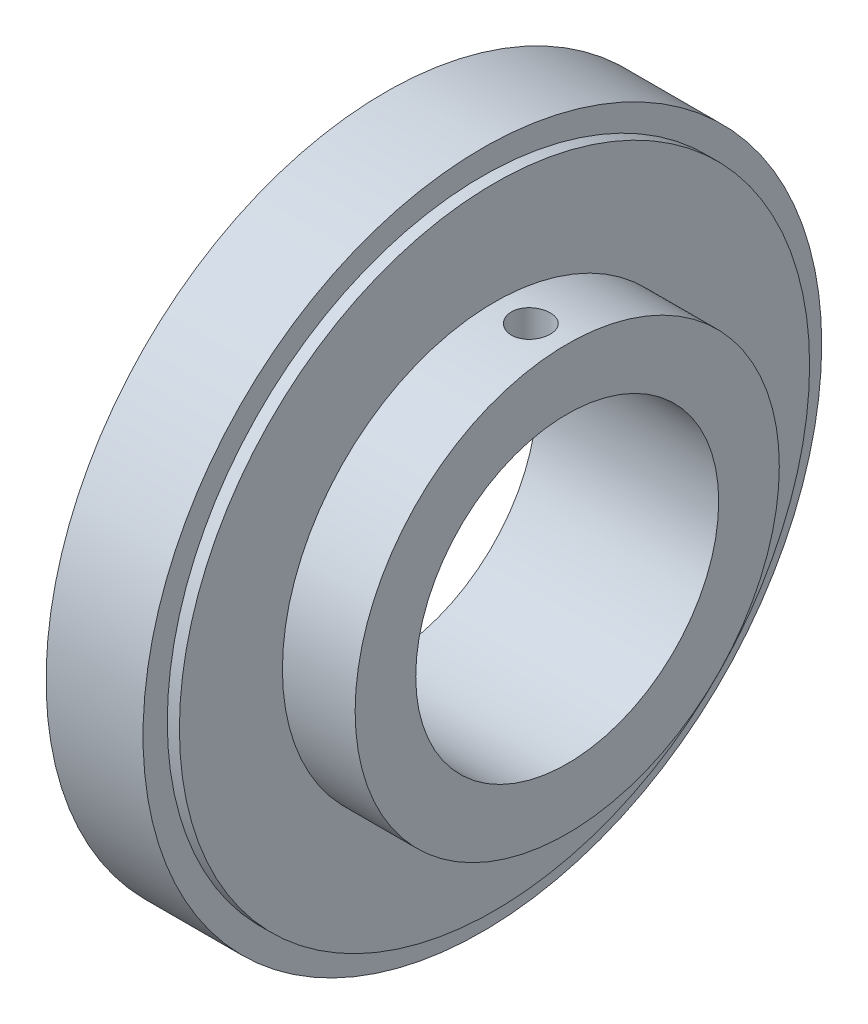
from build123d import *

# Parameters (mm, degrees)
ESQUISSE2_W = 8
ESQUISSE2_H = 10.5
ESQUISSE3_W = 1.6
ESQUISSE3_H = 9


with BuildPart() as part:
    # Esquisse1 → R_volution1 (revolve)
    with BuildSketch(Plane.XY, mode=Mode.PRIVATE) as r_volution1_sk:
        Polygon((0, 12.5), (0, 17.5), (-6, 17.5), (-6, 26), (-7, 26), (-7, 17.5), (-15, 17.5), (-15, 12.5), align=None)
    revolve(r_volution1_sk.sketch.rotate(Axis((0, 0, 0), (-1, 0, 0)), 90), axis=Axis((0, 0, 0), (-1, 0, 0)))

    # Esquisse3 → Enl_vement de mati_re-R_volution1 (revolve, cut)
    with BuildSketch(Plane.XY):
        with Locations((-3.8, 14.5)):
            Rectangle(ESQUISSE3_W, ESQUISSE3_H)
    revolve(axis=Axis((-3, 20.539821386, 0), (0, -1, 0)), mode=Mode.SUBTRACT)


with BuildPart() as body_2:
    # Esquisse2 → R_volution2 (revolve)
    with BuildSketch(Plane.XY, mode=Mode.PRIVATE) as r_volution2_sk:
        with Locations((-11, 22.75)):
            Rectangle(ESQUISSE2_W, ESQUISSE2_H)
    revolve(r_volution2_sk.sketch.rotate(Axis((0, 0, 0), (-1, 0, 0)), 90), axis=Axis((0, 0, 0), (-1, 0, 0)))


solid = Compound([part.part, body_2.part])
